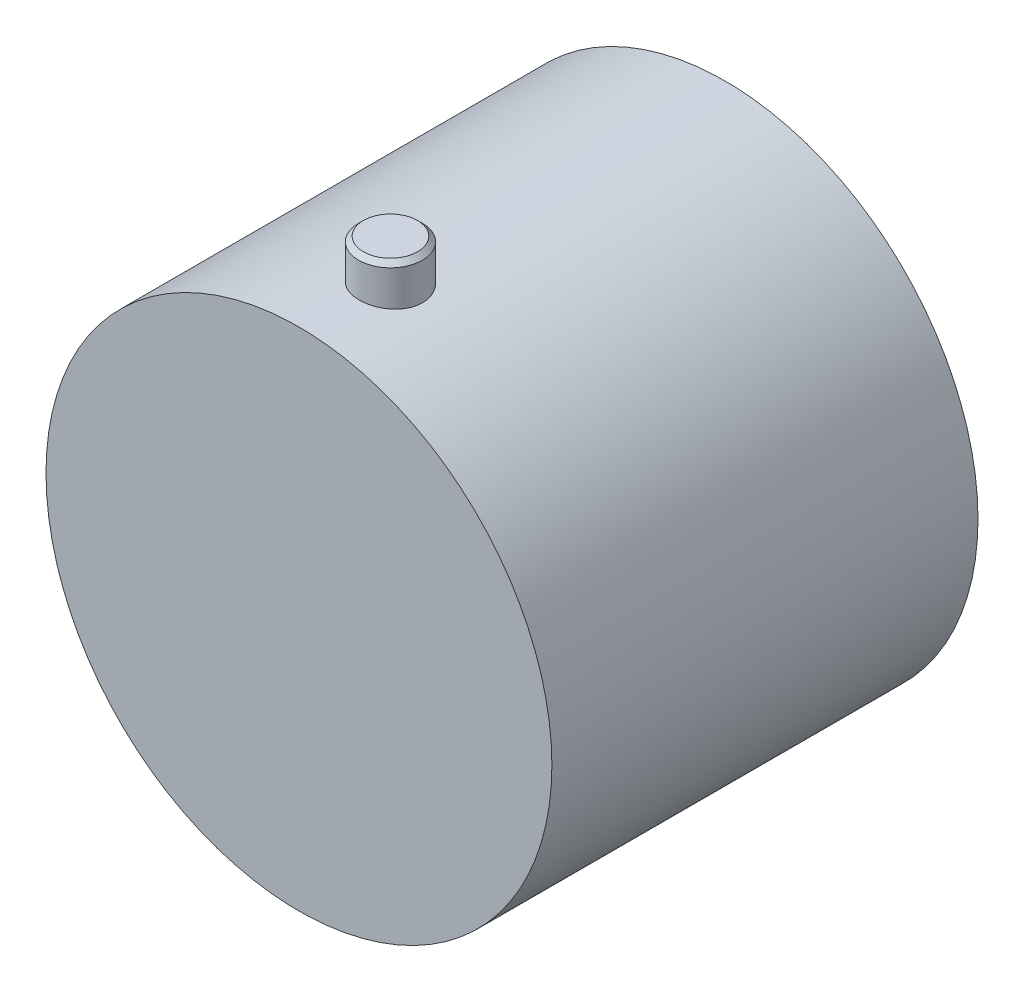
ISO-10303-21;
HEADER;
FILE_DESCRIPTION(('STEP AP214'),'2;1');
FILE_NAME('part.step','',(''),(''),'','','');
FILE_SCHEMA(('AUTOMOTIVE_DESIGN { 1 0 10303 214 1 1 1 1 }'));
ENDSEC;
DATA;
#1=APPLICATION_CONTEXT('core data for automotive mechanical design processes');
#2=APPLICATION_PROTOCOL_DEFINITION('international standard','automotive_design',2000,#1);
#3=PRODUCT_CONTEXT('',#1,'mechanical');
#4=PRODUCT('Part','Part','',(#3));
#5=PRODUCT_RELATED_PRODUCT_CATEGORY('part','',(#4));
#6=PRODUCT_DEFINITION_FORMATION('','',#4);
#7=PRODUCT_DEFINITION_CONTEXT('part definition',#1,'design');
#8=PRODUCT_DEFINITION('design','',#6,#7);
#9=PRODUCT_DEFINITION_SHAPE('','',#8);
#10=(LENGTH_UNIT() NAMED_UNIT(*) SI_UNIT(.MILLI.,.METRE.));
#11=(NAMED_UNIT(*) PLANE_ANGLE_UNIT() SI_UNIT($,.RADIAN.));
#12=(NAMED_UNIT(*) SI_UNIT($,.STERADIAN.) SOLID_ANGLE_UNIT());
#13=UNCERTAINTY_MEASURE_WITH_UNIT(LENGTH_MEASURE(1.E-05),#10,'distance_accuracy_value','');
#14=(GEOMETRIC_REPRESENTATION_CONTEXT(3) GLOBAL_UNCERTAINTY_ASSIGNED_CONTEXT((#13)) GLOBAL_UNIT_ASSIGNED_CONTEXT((#10,
#11,#12)) REPRESENTATION_CONTEXT('',''));
#15=CARTESIAN_POINT('',(0.,0.,0.));
#16=DIRECTION('',(0.,0.,1.));
#17=DIRECTION('',(1.,0.,0.));
#18=AXIS2_PLACEMENT_3D('',#15,#16,#17);
#19=CARTESIAN_POINT('',(0.,0.,43.8));
#20=DIRECTION('',(0.,0.,-1.));
#21=DIRECTION('',(-1.,0.,0.));
#22=AXIS2_PLACEMENT_3D('',#19,#20,#21);
#23=CYLINDRICAL_SURFACE('',#22,26.);
#24=CARTESIAN_POINT('',(0.,0.,0.));
#25=DIRECTION('',(0.,0.,1.));
#26=DIRECTION('',(1.,0.,0.));
#27=AXIS2_PLACEMENT_3D('',#24,#25,#26);
#28=CIRCLE('',#27,26.);
#29=CARTESIAN_POINT('',(26.,0.,0.));
#30=VERTEX_POINT('',#29);
#31=EDGE_CURVE('E53',#30,#30,#28,.T.);
#32=ORIENTED_EDGE('',*,*,#31,.T.);
#33=EDGE_LOOP('',(#32));
#34=FACE_BOUND('',#33,.T.);
#35=CARTESIAN_POINT('',(0.,0.,43.8));
#36=DIRECTION('',(0.,0.,1.));
#37=DIRECTION('',(1.,0.,0.));
#38=AXIS2_PLACEMENT_3D('',#35,#36,#37);
#39=CIRCLE('',#38,26.);
#40=CARTESIAN_POINT('',(26.,0.,43.8));
#41=VERTEX_POINT('',#40);
#42=EDGE_CURVE('E47',#41,#41,#39,.T.);
#43=ORIENTED_EDGE('',*,*,#42,.F.);
#44=EDGE_LOOP('',(#43));
#45=FACE_BOUND('',#44,.T.);
#46=CARTESIAN_POINT('',(0.619957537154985,25.9926076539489,31.7263269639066));
#47=CARTESIAN_POINT('',(0.436484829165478,25.9969811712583,31.7263346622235));
#48=CARTESIAN_POINT('',(0.252853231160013,25.9993994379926,31.7417456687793));
#49=CARTESIAN_POINT('',(-0.109395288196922,26.0004026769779,31.8030253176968));
#50=CARTESIAN_POINT('',(-0.288006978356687,25.9989837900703,31.8489245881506));
#51=CARTESIAN_POINT('',(-0.634915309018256,25.9928253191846,31.9698459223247));
#52=CARTESIAN_POINT('',(-0.803217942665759,25.9880876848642,32.0448508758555));
#53=CARTESIAN_POINT('',(-1.12484961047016,25.9761553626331,32.2218227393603));
#54=CARTESIAN_POINT('',(-1.27818115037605,25.9689610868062,32.3237851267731));
#55=CARTESIAN_POINT('',(-1.56620455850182,25.953187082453,32.5522388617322));
#56=CARTESIAN_POINT('',(-1.70082330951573,25.9446021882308,32.678822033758));
#57=CARTESIAN_POINT('',(-1.94698639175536,25.9272927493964,32.952727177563));
#58=CARTESIAN_POINT('',(-2.05852950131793,25.9185681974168,33.1000502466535));
#59=CARTESIAN_POINT('',(-2.25583473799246,25.9021444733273,33.4119961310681));
#60=CARTESIAN_POINT('',(-2.34148482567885,25.8944498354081,33.5766900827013));
#61=CARTESIAN_POINT('',(-2.48390065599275,25.8811781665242,33.9182060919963));
#62=CARTESIAN_POINT('',(-2.54066704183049,25.8756010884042,34.0950278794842));
#63=CARTESIAN_POINT('',(-2.62354565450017,25.8673298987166,34.4552642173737));
#64=CARTESIAN_POINT('',(-2.6497426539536,25.8646278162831,34.6386590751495));
#65=CARTESIAN_POINT('',(-2.67099537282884,25.8624419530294,35.0072606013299));
#66=CARTESIAN_POINT('',(-2.6660519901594,25.8629580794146,35.1924672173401));
#67=CARTESIAN_POINT('',(-2.62525712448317,25.8671303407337,35.5586335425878));
#68=CARTESIAN_POINT('',(-2.58953252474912,25.8707735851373,35.7396075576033));
#69=CARTESIAN_POINT('',(-2.4883856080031,25.8806973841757,36.0929799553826));
#70=CARTESIAN_POINT('',(-2.42296276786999,25.8869779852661,36.2653781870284));
#71=CARTESIAN_POINT('',(-2.26413230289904,25.901352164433,36.5971030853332));
#72=CARTESIAN_POINT('',(-2.17066874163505,25.9094493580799,36.7564028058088));
#73=CARTESIAN_POINT('',(-1.95844007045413,25.9263535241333,37.0571084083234));
#74=CARTESIAN_POINT('',(-1.83967414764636,25.935160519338,37.1985137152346));
#75=CARTESIAN_POINT('',(-1.57955935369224,25.9523027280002,37.4600836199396));
#76=CARTESIAN_POINT('',(-1.4381105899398,25.9606356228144,37.5801490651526));
#77=CARTESIAN_POINT('',(-1.13698804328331,25.975564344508,37.7948433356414));
#78=CARTESIAN_POINT('',(-0.97731446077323,25.9821601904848,37.8894724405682));
#79=CARTESIAN_POINT('',(-0.644493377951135,25.9925426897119,38.0504570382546));
#80=CARTESIAN_POINT('',(-0.471365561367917,25.9963333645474,38.1168529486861));
#81=CARTESIAN_POINT('',(-0.116382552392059,26.0003449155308,38.2196337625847));
#82=CARTESIAN_POINT('',(0.0654722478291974,26.0005659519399,38.2560200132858));
#83=CARTESIAN_POINT('',(0.43155392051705,25.9970586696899,38.2976083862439));
#84=CARTESIAN_POINT('',(0.615759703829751,25.993354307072,38.3029983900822));
#85=CARTESIAN_POINT('',(0.982367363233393,25.9820821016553,38.2829850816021));
#86=CARTESIAN_POINT('',(1.16476925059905,25.9745142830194,38.2575819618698));
#87=CARTESIAN_POINT('',(1.52248871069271,25.9560031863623,38.1768064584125));
#88=CARTESIAN_POINT('',(1.69781123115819,25.9450623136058,38.1214554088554));
#89=CARTESIAN_POINT('',(2.03665263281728,25.9206660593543,37.9824272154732));
#90=CARTESIAN_POINT('',(2.20017093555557,25.9072105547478,37.8987486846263));
#91=CARTESIAN_POINT('',(2.51208534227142,25.8788362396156,37.7047128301));
#92=CARTESIAN_POINT('',(2.66036038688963,25.8639073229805,37.5941623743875));
#93=CARTESIAN_POINT('',(2.936310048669,25.8340353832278,37.3497925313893));
#94=CARTESIAN_POINT('',(3.06398379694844,25.819092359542,37.2159721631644));
#95=CARTESIAN_POINT('',(3.29581011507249,25.7905290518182,36.9279536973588));
#96=CARTESIAN_POINT('',(3.39983028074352,25.7769164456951,36.7736481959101));
#97=CARTESIAN_POINT('',(3.58044635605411,25.7524512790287,36.4495425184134));
#98=CARTESIAN_POINT('',(3.65704328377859,25.7415986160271,36.279742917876));
#99=CARTESIAN_POINT('',(3.78019865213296,25.7238017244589,35.9304180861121));
#100=CARTESIAN_POINT('',(3.82691766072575,25.7168366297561,35.7509505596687));
#101=CARTESIAN_POINT('',(3.88954850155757,25.7074392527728,35.386605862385));
#102=CARTESIAN_POINT('',(3.90546237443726,25.705006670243,35.2017290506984));
#103=CARTESIAN_POINT('',(3.90599317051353,25.7049258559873,34.8337470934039));
#104=CARTESIAN_POINT('',(3.89091495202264,25.7072310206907,34.6506423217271));
#105=CARTESIAN_POINT('',(3.83053569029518,25.7162966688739,34.2896036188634));
#106=CARTESIAN_POINT('',(3.78523472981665,25.7230571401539,34.1116696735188));
#107=CARTESIAN_POINT('',(3.66579459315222,25.740348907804,33.7660654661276));
#108=CARTESIAN_POINT('',(3.59166999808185,25.7508782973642,33.5983900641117));
#109=CARTESIAN_POINT('',(3.41672680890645,25.7746723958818,33.2778165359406));
#110=CARTESIAN_POINT('',(3.31590751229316,25.7879371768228,33.1249187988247));
#111=CARTESIAN_POINT('',(3.08933632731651,25.8160631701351,32.8366935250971));
#112=CARTESIAN_POINT('',(2.96335996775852,25.8309381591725,32.7015437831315));
#113=CARTESIAN_POINT('',(2.69054523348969,25.8607764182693,32.4541942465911));
#114=CARTESIAN_POINT('',(2.54370158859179,25.8757397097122,32.3420002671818));
#115=CARTESIAN_POINT('',(2.23217250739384,25.9044787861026,32.1430462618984));
#116=CARTESIAN_POINT('',(2.067372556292,25.9182458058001,32.0564643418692));
#117=CARTESIAN_POINT('',(1.72548537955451,25.9432450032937,31.9123492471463));
#118=CARTESIAN_POINT('',(1.54841155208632,25.9544798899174,31.8547849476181));
#119=CARTESIAN_POINT('',(1.24537706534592,25.9704473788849,31.7839440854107));
#120=CARTESIAN_POINT('',(1.12134036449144,25.9761085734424,31.7623727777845));
#121=CARTESIAN_POINT('',(0.871546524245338,25.9856889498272,31.7335616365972));
#122=CARTESIAN_POINT('',(0.745789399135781,25.9896081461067,31.7263216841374));
#123=CARTESIAN_POINT('',(0.619957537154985,25.9926076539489,31.7263269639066));
#124=B_SPLINE_CURVE_WITH_KNOTS('',3,(#46,#47,#48,#49,#50,#51,#52,#53,#54,#55,#56,#57,#58,#59,
#60,#61,#62,#63,#64,#65,#66,#67,#68,#69,#70,#71,#72,#73,#74,#75,#76,#77,#78,#79,#80,#81,#82,#83,
#84,#85,#86,#87,#88,#89,#90,#91,#92,#93,#94,#95,#96,#97,#98,#99,#100,#101,#102,#103,#104,#105,
#106,#107,#108,#109,#110,#111,#112,#113,#114,#115,#116,#117,#118,#119,#120,#121,#122,#123),
.UNSPECIFIED.,.T.,.F.,(4,2,2,2,2,2,2,2,2,2,2,2,2,2,2,2,2,2,2,2,2,2,2,2,2,2,2,2,2,2,2,2,2,2,2,2,
2,2,4),(0.,0.550116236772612,1.1007859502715,1.65113243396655,2.20138664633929,2.75373383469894,
3.3061102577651,3.8608436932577,4.41556477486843,4.96874386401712,5.52190700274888,
6.07280079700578,6.62370429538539,7.17571414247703,7.72774172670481,8.28227074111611,
8.83679365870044,9.39052004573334,9.94422157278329,10.4945633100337,11.0449016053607,
11.5948483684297,12.1448220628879,12.698871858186,13.2529450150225,13.8100472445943,
14.3671287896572,14.9211907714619,15.4752160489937,16.0238176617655,16.5724177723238,
17.1207407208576,17.6690781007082,18.2225463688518,18.7761546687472,19.3335268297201,
19.8902998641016,20.2675915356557,20.6448800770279),.UNSPECIFIED.);
#125=CARTESIAN_POINT('',(0.619957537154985,25.9926076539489,31.7263269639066));
#126=VERTEX_POINT('',#125);
#127=EDGE_CURVE('E43',#126,#126,#124,.T.);
#128=ORIENTED_EDGE('',*,*,#127,.F.);
#129=EDGE_LOOP('',(#128));
#130=FACE_BOUND('',#129,.T.);
#131=ADVANCED_FACE('F32',(#34,#45,#130),#23,.T.);
#132=CARTESIAN_POINT('',(0.,0.,43.8));
#133=DIRECTION('',(0.,0.,1.));
#134=DIRECTION('',(1.,0.,0.));
#135=AXIS2_PLACEMENT_3D('',#132,#133,#134);
#136=PLANE('',#135);
#137=ORIENTED_EDGE('',*,*,#42,.T.);
#138=EDGE_LOOP('',(#137));
#139=FACE_BOUND('',#138,.T.);
#140=ADVANCED_FACE('F64',(#139),#136,.T.);
#141=CARTESIAN_POINT('',(0.,0.,0.));
#142=DIRECTION('',(0.,0.,1.));
#143=DIRECTION('',(1.,0.,0.));
#144=AXIS2_PLACEMENT_3D('',#141,#142,#143);
#145=PLANE('',#144);
#146=ORIENTED_EDGE('',*,*,#31,.F.);
#147=EDGE_LOOP('',(#146));
#148=FACE_BOUND('',#147,.T.);
#149=ADVANCED_FACE('F63',(#148),#145,.F.);
#150=CARTESIAN_POINT('',(0.619957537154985,30.,35.012101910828));
#151=DIRECTION('',(0.,-1.,0.));
#152=DIRECTION('',(0.,0.,-1.));
#153=AXIS2_PLACEMENT_3D('',#150,#151,#152);
#154=CYLINDRICAL_SURFACE('',#153,3.28577494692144);
#155=CARTESIAN_POINT('',(0.619957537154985,29.5,35.012101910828));
#156=DIRECTION('',(0.,1.,0.));
#157=DIRECTION('',(0.,0.,1.));
#158=AXIS2_PLACEMENT_3D('',#155,#156,#157);
#159=CIRCLE('',#158,3.28577494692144);
#160=CARTESIAN_POINT('',(0.619957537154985,29.5,38.2978768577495));
#161=VERTEX_POINT('',#160);
#162=EDGE_CURVE('E10',#161,#161,#159,.F.);
#163=ORIENTED_EDGE('',*,*,#162,.T.);
#164=EDGE_LOOP('',(#163));
#165=FACE_BOUND('',#164,.T.);
#166=ORIENTED_EDGE('',*,*,#127,.T.);
#167=EDGE_LOOP('',(#166));
#168=FACE_BOUND('',#167,.T.);
#169=ADVANCED_FACE('F57',(#165,#168),#154,.T.);
#170=CARTESIAN_POINT('',(0.619957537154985,30.,35.012101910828));
#171=DIRECTION('',(0.,1.,0.));
#172=DIRECTION('',(0.,0.,1.));
#173=AXIS2_PLACEMENT_3D('',#170,#171,#172);
#174=PLANE('',#173);
#175=CARTESIAN_POINT('',(0.619957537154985,30.,35.012101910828));
#176=DIRECTION('',(0.,1.,0.));
#177=DIRECTION('',(0.,0.,1.));
#178=AXIS2_PLACEMENT_3D('',#175,#176,#177);
#179=CIRCLE('',#178,2.78577494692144);
#180=CARTESIAN_POINT('',(0.619957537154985,30.,37.7978768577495));
#181=VERTEX_POINT('',#180);
#182=EDGE_CURVE('E39',#181,#181,#179,.T.);
#183=ORIENTED_EDGE('',*,*,#182,.T.);
#184=EDGE_LOOP('',(#183));
#185=FACE_BOUND('',#184,.T.);
#186=ADVANCED_FACE('F62',(#185),#174,.T.);
#187=CARTESIAN_POINT('',(0.619957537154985,30.,35.012101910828));
#188=DIRECTION('',(0.,-1.,0.));
#189=DIRECTION('',(0.,0.,-1.));
#190=AXIS2_PLACEMENT_3D('',#187,#188,#189);
#191=CONICAL_SURFACE('',#190,2.78577494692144,0.785398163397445);
#192=ORIENTED_EDGE('',*,*,#162,.F.);
#193=EDGE_LOOP('',(#192));
#194=FACE_BOUND('',#193,.T.);
#195=ORIENTED_EDGE('',*,*,#182,.F.);
#196=EDGE_LOOP('',(#195));
#197=FACE_BOUND('',#196,.T.);
#198=ADVANCED_FACE('F34',(#194,#197),#191,.T.);
#199=CLOSED_SHELL('',(#131,#140,#149,#169,#186,#198));
#200=MANIFOLD_SOLID_BREP('B2',#199);
#201=ADVANCED_BREP_SHAPE_REPRESENTATION('',(#18,#200),#14);
#202=SHAPE_DEFINITION_REPRESENTATION(#9,#201);
ENDSEC;
END-ISO-10303-21;
